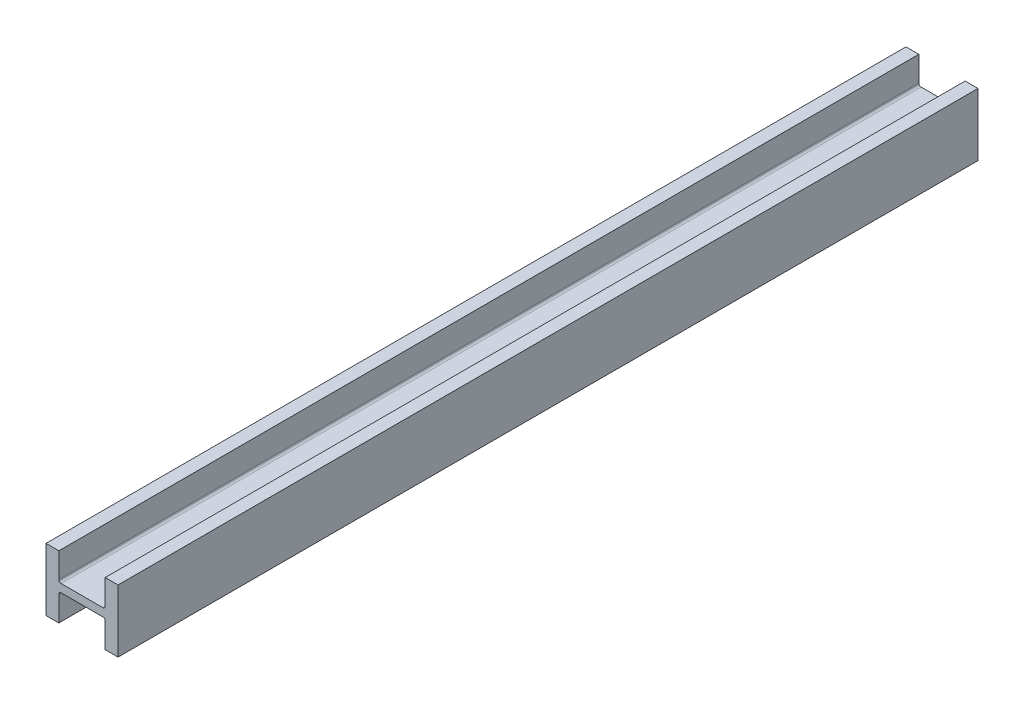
ISO-10303-21;
HEADER;
FILE_DESCRIPTION(('STEP AP214'),'2;1');
FILE_NAME('part.step','',(''),(''),'','','');
FILE_SCHEMA(('AUTOMOTIVE_DESIGN { 1 0 10303 214 1 1 1 1 }'));
ENDSEC;
DATA;
#1=APPLICATION_CONTEXT('core data for automotive mechanical design processes');
#2=APPLICATION_PROTOCOL_DEFINITION('international standard','automotive_design',2000,#1);
#3=PRODUCT_CONTEXT('',#1,'mechanical');
#4=PRODUCT('Part','Part','',(#3));
#5=PRODUCT_RELATED_PRODUCT_CATEGORY('part','',(#4));
#6=PRODUCT_DEFINITION_FORMATION('','',#4);
#7=PRODUCT_DEFINITION_CONTEXT('part definition',#1,'design');
#8=PRODUCT_DEFINITION('design','',#6,#7);
#9=PRODUCT_DEFINITION_SHAPE('','',#8);
#10=(LENGTH_UNIT() NAMED_UNIT(*) SI_UNIT(.MILLI.,.METRE.));
#11=(NAMED_UNIT(*) PLANE_ANGLE_UNIT() SI_UNIT($,.RADIAN.));
#12=(NAMED_UNIT(*) SI_UNIT($,.STERADIAN.) SOLID_ANGLE_UNIT());
#13=UNCERTAINTY_MEASURE_WITH_UNIT(LENGTH_MEASURE(1.E-05),#10,'distance_accuracy_value','');
#14=(GEOMETRIC_REPRESENTATION_CONTEXT(3) GLOBAL_UNCERTAINTY_ASSIGNED_CONTEXT((#13)) GLOBAL_UNIT_ASSIGNED_CONTEXT((#10,
#11,#12)) REPRESENTATION_CONTEXT('',''));
#15=CARTESIAN_POINT('',(0.,0.,0.));
#16=DIRECTION('',(0.,0.,1.));
#17=DIRECTION('',(1.,0.,0.));
#18=AXIS2_PLACEMENT_3D('',#15,#16,#17);
#19=CARTESIAN_POINT('',(248.92,216.027000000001,2971.8));
#20=DIRECTION('',(-1.,0.,0.));
#21=DIRECTION('',(0.,0.,1.));
#22=AXIS2_PLACEMENT_3D('',#19,#20,#21);
#23=PLANE('',#22);
#24=DIRECTION('',(0.,1.,0.));
#25=VECTOR('',#24,1.);
#26=CARTESIAN_POINT('',(248.92,216.027000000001,-2971.8));
#27=LINE('',#26,#25);
#28=CARTESIAN_POINT('',(248.92,-216.026999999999,-2971.8));
#29=VERTEX_POINT('',#28);
#30=CARTESIAN_POINT('',(248.92,216.027000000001,-2971.8));
#31=VERTEX_POINT('',#30);
#32=EDGE_CURVE('E195',#29,#31,#27,.T.);
#33=ORIENTED_EDGE('',*,*,#32,.T.);
#34=DIRECTION('',(0.,0.,-1.));
#35=VECTOR('',#34,1.);
#36=CARTESIAN_POINT('',(248.92,216.027000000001,2971.8));
#37=LINE('',#36,#35);
#38=CARTESIAN_POINT('',(248.92,216.027000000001,2971.8));
#39=VERTEX_POINT('',#38);
#40=EDGE_CURVE('E11',#39,#31,#37,.T.);
#41=ORIENTED_EDGE('',*,*,#40,.F.);
#42=DIRECTION('',(0.,1.,0.));
#43=VECTOR('',#42,1.);
#44=CARTESIAN_POINT('',(248.92,216.027000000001,2971.8));
#45=LINE('',#44,#43);
#46=CARTESIAN_POINT('',(248.92,-216.026999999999,2971.8));
#47=VERTEX_POINT('',#46);
#48=EDGE_CURVE('E238',#47,#39,#45,.T.);
#49=ORIENTED_EDGE('',*,*,#48,.F.);
#50=DIRECTION('',(0.,0.,-1.));
#51=VECTOR('',#50,1.);
#52=CARTESIAN_POINT('',(248.92,-216.026999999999,2971.8));
#53=LINE('',#52,#51);
#54=EDGE_CURVE('E186',#47,#29,#53,.T.);
#55=ORIENTED_EDGE('',*,*,#54,.T.);
#56=EDGE_LOOP('',(#33,#41,#49,#55));
#57=FACE_BOUND('',#56,.T.);
#58=ADVANCED_FACE('F44',(#57),#23,.F.);
#59=CARTESIAN_POINT('',(160.02,216.027000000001,2971.8));
#60=DIRECTION('',(0.,-1.,0.));
#61=DIRECTION('',(0.,0.,-1.));
#62=AXIS2_PLACEMENT_3D('',#59,#60,#61);
#63=PLANE('',#62);
#64=DIRECTION('',(-1.,0.,0.));
#65=VECTOR('',#64,1.);
#66=CARTESIAN_POINT('',(160.02,216.027000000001,-2971.8));
#67=LINE('',#66,#65);
#68=CARTESIAN_POINT('',(160.02,216.027000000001,-2971.8));
#69=VERTEX_POINT('',#68);
#70=EDGE_CURVE('E196',#31,#69,#67,.T.);
#71=ORIENTED_EDGE('',*,*,#70,.T.);
#72=DIRECTION('',(0.,0.,-1.));
#73=VECTOR('',#72,1.);
#74=CARTESIAN_POINT('',(160.02,216.027000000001,2971.8));
#75=LINE('',#74,#73);
#76=CARTESIAN_POINT('',(160.02,216.027000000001,2971.8));
#77=VERTEX_POINT('',#76);
#78=EDGE_CURVE('E53',#77,#69,#75,.T.);
#79=ORIENTED_EDGE('',*,*,#78,.F.);
#80=DIRECTION('',(-1.,0.,0.));
#81=VECTOR('',#80,1.);
#82=CARTESIAN_POINT('',(160.02,216.027000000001,2971.8));
#83=LINE('',#82,#81);
#84=EDGE_CURVE('E129',#39,#77,#83,.T.);
#85=ORIENTED_EDGE('',*,*,#84,.F.);
#86=ORIENTED_EDGE('',*,*,#40,.T.);
#87=EDGE_LOOP('',(#71,#79,#85,#86));
#88=FACE_BOUND('',#87,.T.);
#89=ADVANCED_FACE('F362',(#88),#63,.F.);
#90=CARTESIAN_POINT('',(160.02,43.0530000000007,2971.8));
#91=DIRECTION('',(1.,0.,0.));
#92=DIRECTION('',(0.,0.,-1.));
#93=AXIS2_PLACEMENT_3D('',#90,#91,#92);
#94=PLANE('',#93);
#95=DIRECTION('',(0.,-1.,0.));
#96=VECTOR('',#95,1.);
#97=CARTESIAN_POINT('',(160.02,43.0530000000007,-2971.8));
#98=LINE('',#97,#96);
#99=CARTESIAN_POINT('',(160.02,43.0530000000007,-2971.8));
#100=VERTEX_POINT('',#99);
#101=EDGE_CURVE('E203',#69,#100,#98,.T.);
#102=ORIENTED_EDGE('',*,*,#101,.T.);
#103=DIRECTION('',(0.,0.,-1.));
#104=VECTOR('',#103,1.);
#105=CARTESIAN_POINT('',(160.02,43.0530000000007,2971.8));
#106=LINE('',#105,#104);
#107=CARTESIAN_POINT('',(160.02,43.0530000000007,2971.8));
#108=VERTEX_POINT('',#107);
#109=EDGE_CURVE('E282',#108,#100,#106,.T.);
#110=ORIENTED_EDGE('',*,*,#109,.F.);
#111=DIRECTION('',(0.,-1.,0.));
#112=VECTOR('',#111,1.);
#113=CARTESIAN_POINT('',(160.02,43.0530000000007,2971.8));
#114=LINE('',#113,#112);
#115=EDGE_CURVE('E291',#77,#108,#114,.T.);
#116=ORIENTED_EDGE('',*,*,#115,.F.);
#117=ORIENTED_EDGE('',*,*,#78,.T.);
#118=EDGE_LOOP('',(#102,#110,#116,#117));
#119=FACE_BOUND('',#118,.T.);
#120=ADVANCED_FACE('F292',(#119),#94,.F.);
#121=CARTESIAN_POINT('',(144.78,43.0530000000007,2971.8));
#122=DIRECTION('',(0.,0.,-1.));
#123=DIRECTION('',(-1.,0.,0.));
#124=AXIS2_PLACEMENT_3D('',#121,#122,#123);
#125=CYLINDRICAL_SURFACE('',#124,15.24);
#126=CARTESIAN_POINT('',(144.78,43.0530000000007,-2971.8));
#127=DIRECTION('',(0.,0.,-1.));
#128=DIRECTION('',(1.,0.,0.));
#129=AXIS2_PLACEMENT_3D('',#126,#127,#128);
#130=CIRCLE('',#129,15.24);
#131=CARTESIAN_POINT('',(144.78,27.8130000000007,-2971.8));
#132=VERTEX_POINT('',#131);
#133=EDGE_CURVE('E204',#100,#132,#130,.T.);
#134=ORIENTED_EDGE('',*,*,#133,.T.);
#135=DIRECTION('',(0.,0.,-1.));
#136=VECTOR('',#135,1.);
#137=CARTESIAN_POINT('',(144.78,27.8130000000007,2971.8));
#138=LINE('',#137,#136);
#139=CARTESIAN_POINT('',(144.78,27.8130000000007,2971.8));
#140=VERTEX_POINT('',#139);
#141=EDGE_CURVE('E276',#140,#132,#138,.T.);
#142=ORIENTED_EDGE('',*,*,#141,.F.);
#143=CARTESIAN_POINT('',(144.78,43.0530000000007,2971.8));
#144=DIRECTION('',(0.,0.,-1.));
#145=DIRECTION('',(1.,0.,0.));
#146=AXIS2_PLACEMENT_3D('',#143,#144,#145);
#147=CIRCLE('',#146,15.24);
#148=EDGE_CURVE('E315',#108,#140,#147,.T.);
#149=ORIENTED_EDGE('',*,*,#148,.F.);
#150=ORIENTED_EDGE('',*,*,#109,.T.);
#151=EDGE_LOOP('',(#134,#142,#149,#150));
#152=FACE_BOUND('',#151,.T.);
#153=ADVANCED_FACE('F304',(#152),#125,.F.);
#154=CARTESIAN_POINT('',(-144.78,27.8130000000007,2971.8));
#155=DIRECTION('',(0.,-1.,0.));
#156=DIRECTION('',(0.,0.,-1.));
#157=AXIS2_PLACEMENT_3D('',#154,#155,#156);
#158=PLANE('',#157);
#159=DIRECTION('',(-1.,0.,0.));
#160=VECTOR('',#159,1.);
#161=CARTESIAN_POINT('',(-144.78,27.8130000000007,-2971.8));
#162=LINE('',#161,#160);
#163=CARTESIAN_POINT('',(-144.78,27.8130000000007,-2971.8));
#164=VERTEX_POINT('',#163);
#165=EDGE_CURVE('E210',#132,#164,#162,.T.);
#166=ORIENTED_EDGE('',*,*,#165,.T.);
#167=DIRECTION('',(0.,0.,-1.));
#168=VECTOR('',#167,1.);
#169=CARTESIAN_POINT('',(-144.78,27.8130000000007,2971.8));
#170=LINE('',#169,#168);
#171=CARTESIAN_POINT('',(-144.78,27.8130000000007,2971.8));
#172=VERTEX_POINT('',#171);
#173=EDGE_CURVE('E274',#172,#164,#170,.T.);
#174=ORIENTED_EDGE('',*,*,#173,.F.);
#175=DIRECTION('',(-1.,0.,0.));
#176=VECTOR('',#175,1.);
#177=CARTESIAN_POINT('',(-144.78,27.8130000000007,2971.8));
#178=LINE('',#177,#176);
#179=EDGE_CURVE('E306',#140,#172,#178,.T.);
#180=ORIENTED_EDGE('',*,*,#179,.F.);
#181=ORIENTED_EDGE('',*,*,#141,.T.);
#182=EDGE_LOOP('',(#166,#174,#180,#181));
#183=FACE_BOUND('',#182,.T.);
#184=ADVANCED_FACE('F308',(#183),#158,.F.);
#185=CARTESIAN_POINT('',(-144.78,43.0530000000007,2971.8));
#186=DIRECTION('',(0.,0.,-1.));
#187=DIRECTION('',(-1.,0.,0.));
#188=AXIS2_PLACEMENT_3D('',#185,#186,#187);
#189=CYLINDRICAL_SURFACE('',#188,15.24);
#190=CARTESIAN_POINT('',(-144.78,43.0530000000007,-2971.8));
#191=DIRECTION('',(0.,0.,-1.));
#192=DIRECTION('',(1.,0.,0.));
#193=AXIS2_PLACEMENT_3D('',#190,#191,#192);
#194=CIRCLE('',#193,15.24);
#195=CARTESIAN_POINT('',(-160.02,43.0530000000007,-2971.8));
#196=VERTEX_POINT('',#195);
#197=EDGE_CURVE('E209',#164,#196,#194,.T.);
#198=ORIENTED_EDGE('',*,*,#197,.T.);
#199=DIRECTION('',(0.,0.,-1.));
#200=VECTOR('',#199,1.);
#201=CARTESIAN_POINT('',(-160.02,43.0530000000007,2971.8));
#202=LINE('',#201,#200);
#203=CARTESIAN_POINT('',(-160.02,43.0530000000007,2971.8));
#204=VERTEX_POINT('',#203);
#205=EDGE_CURVE('E271',#204,#196,#202,.T.);
#206=ORIENTED_EDGE('',*,*,#205,.F.);
#207=CARTESIAN_POINT('',(-144.78,43.0530000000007,2971.8));
#208=DIRECTION('',(0.,0.,-1.));
#209=DIRECTION('',(1.,0.,0.));
#210=AXIS2_PLACEMENT_3D('',#207,#208,#209);
#211=CIRCLE('',#210,15.24);
#212=EDGE_CURVE('E313',#172,#204,#211,.T.);
#213=ORIENTED_EDGE('',*,*,#212,.F.);
#214=ORIENTED_EDGE('',*,*,#173,.T.);
#215=EDGE_LOOP('',(#198,#206,#213,#214));
#216=FACE_BOUND('',#215,.T.);
#217=ADVANCED_FACE('F374',(#216),#189,.F.);
#218=CARTESIAN_POINT('',(-160.02,216.027000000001,2971.8));
#219=DIRECTION('',(-1.,0.,0.));
#220=DIRECTION('',(0.,0.,1.));
#221=AXIS2_PLACEMENT_3D('',#218,#219,#220);
#222=PLANE('',#221);
#223=DIRECTION('',(0.,1.,0.));
#224=VECTOR('',#223,1.);
#225=CARTESIAN_POINT('',(-160.02,216.027000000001,-2971.8));
#226=LINE('',#225,#224);
#227=CARTESIAN_POINT('',(-160.02,216.027000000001,-2971.8));
#228=VERTEX_POINT('',#227);
#229=EDGE_CURVE('E213',#196,#228,#226,.T.);
#230=ORIENTED_EDGE('',*,*,#229,.T.);
#231=DIRECTION('',(0.,0.,-1.));
#232=VECTOR('',#231,1.);
#233=CARTESIAN_POINT('',(-160.02,216.027000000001,2971.8));
#234=LINE('',#233,#232);
#235=CARTESIAN_POINT('',(-160.02,216.027000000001,2971.8));
#236=VERTEX_POINT('',#235);
#237=EDGE_CURVE('E270',#236,#228,#234,.T.);
#238=ORIENTED_EDGE('',*,*,#237,.F.);
#239=DIRECTION('',(0.,1.,0.));
#240=VECTOR('',#239,1.);
#241=CARTESIAN_POINT('',(-160.02,216.027000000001,2971.8));
#242=LINE('',#241,#240);
#243=EDGE_CURVE('E316',#204,#236,#242,.T.);
#244=ORIENTED_EDGE('',*,*,#243,.F.);
#245=ORIENTED_EDGE('',*,*,#205,.T.);
#246=EDGE_LOOP('',(#230,#238,#244,#245));
#247=FACE_BOUND('',#246,.T.);
#248=ADVANCED_FACE('F378',(#247),#222,.F.);
#249=CARTESIAN_POINT('',(-248.92,216.027000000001,2971.8));
#250=DIRECTION('',(0.,-1.,0.));
#251=DIRECTION('',(0.,0.,-1.));
#252=AXIS2_PLACEMENT_3D('',#249,#250,#251);
#253=PLANE('',#252);
#254=DIRECTION('',(-1.,0.,0.));
#255=VECTOR('',#254,1.);
#256=CARTESIAN_POINT('',(-248.92,216.027000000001,-2971.8));
#257=LINE('',#256,#255);
#258=CARTESIAN_POINT('',(-248.92,216.027000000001,-2971.8));
#259=VERTEX_POINT('',#258);
#260=EDGE_CURVE('E216',#228,#259,#257,.T.);
#261=ORIENTED_EDGE('',*,*,#260,.T.);
#262=DIRECTION('',(0.,0.,-1.));
#263=VECTOR('',#262,1.);
#264=CARTESIAN_POINT('',(-248.92,216.027000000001,2971.8));
#265=LINE('',#264,#263);
#266=CARTESIAN_POINT('',(-248.92,216.027000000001,2971.8));
#267=VERTEX_POINT('',#266);
#268=EDGE_CURVE('E263',#267,#259,#265,.T.);
#269=ORIENTED_EDGE('',*,*,#268,.F.);
#270=DIRECTION('',(-1.,0.,0.));
#271=VECTOR('',#270,1.);
#272=CARTESIAN_POINT('',(-248.92,216.027000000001,2971.8));
#273=LINE('',#272,#271);
#274=EDGE_CURVE('E323',#236,#267,#273,.T.);
#275=ORIENTED_EDGE('',*,*,#274,.F.);
#276=ORIENTED_EDGE('',*,*,#237,.T.);
#277=EDGE_LOOP('',(#261,#269,#275,#276));
#278=FACE_BOUND('',#277,.T.);
#279=ADVANCED_FACE('F385',(#278),#253,.F.);
#280=CARTESIAN_POINT('',(-248.92,-216.026999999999,2971.8));
#281=DIRECTION('',(1.,0.,0.));
#282=DIRECTION('',(0.,0.,-1.));
#283=AXIS2_PLACEMENT_3D('',#280,#281,#282);
#284=PLANE('',#283);
#285=DIRECTION('',(0.,-1.,0.));
#286=VECTOR('',#285,1.);
#287=CARTESIAN_POINT('',(-248.92,-216.026999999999,-2971.8));
#288=LINE('',#287,#286);
#289=CARTESIAN_POINT('',(-248.92,-216.026999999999,-2971.8));
#290=VERTEX_POINT('',#289);
#291=EDGE_CURVE('E218',#259,#290,#288,.T.);
#292=ORIENTED_EDGE('',*,*,#291,.T.);
#293=DIRECTION('',(0.,0.,-1.));
#294=VECTOR('',#293,1.);
#295=CARTESIAN_POINT('',(-248.92,-216.026999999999,2971.8));
#296=LINE('',#295,#294);
#297=CARTESIAN_POINT('',(-248.92,-216.026999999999,2971.8));
#298=VERTEX_POINT('',#297);
#299=EDGE_CURVE('E259',#298,#290,#296,.T.);
#300=ORIENTED_EDGE('',*,*,#299,.F.);
#301=DIRECTION('',(0.,-1.,0.));
#302=VECTOR('',#301,1.);
#303=CARTESIAN_POINT('',(-248.92,-216.026999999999,2971.8));
#304=LINE('',#303,#302);
#305=EDGE_CURVE('E326',#267,#298,#304,.T.);
#306=ORIENTED_EDGE('',*,*,#305,.F.);
#307=ORIENTED_EDGE('',*,*,#268,.T.);
#308=EDGE_LOOP('',(#292,#300,#306,#307));
#309=FACE_BOUND('',#308,.T.);
#310=ADVANCED_FACE('F387',(#309),#284,.F.);
#311=CARTESIAN_POINT('',(-160.02,-216.026999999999,2971.8));
#312=DIRECTION('',(0.,1.,0.));
#313=DIRECTION('',(0.,0.,1.));
#314=AXIS2_PLACEMENT_3D('',#311,#312,#313);
#315=PLANE('',#314);
#316=DIRECTION('',(1.,0.,0.));
#317=VECTOR('',#316,1.);
#318=CARTESIAN_POINT('',(-160.02,-216.026999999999,-2971.8));
#319=LINE('',#318,#317);
#320=CARTESIAN_POINT('',(-160.02,-216.026999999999,-2971.8));
#321=VERTEX_POINT('',#320);
#322=EDGE_CURVE('E225',#290,#321,#319,.T.);
#323=ORIENTED_EDGE('',*,*,#322,.T.);
#324=DIRECTION('',(0.,0.,-1.));
#325=VECTOR('',#324,1.);
#326=CARTESIAN_POINT('',(-160.02,-216.026999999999,2971.8));
#327=LINE('',#326,#325);
#328=CARTESIAN_POINT('',(-160.02,-216.026999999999,2971.8));
#329=VERTEX_POINT('',#328);
#330=EDGE_CURVE('E254',#329,#321,#327,.T.);
#331=ORIENTED_EDGE('',*,*,#330,.F.);
#332=DIRECTION('',(1.,0.,0.));
#333=VECTOR('',#332,1.);
#334=CARTESIAN_POINT('',(-160.02,-216.026999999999,2971.8));
#335=LINE('',#334,#333);
#336=EDGE_CURVE('E328',#298,#329,#335,.T.);
#337=ORIENTED_EDGE('',*,*,#336,.F.);
#338=ORIENTED_EDGE('',*,*,#299,.T.);
#339=EDGE_LOOP('',(#323,#331,#337,#338));
#340=FACE_BOUND('',#339,.T.);
#341=ADVANCED_FACE('F388',(#340),#315,.F.);
#342=CARTESIAN_POINT('',(-160.02,-43.0529999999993,2971.8));
#343=DIRECTION('',(-1.,0.,0.));
#344=DIRECTION('',(0.,-1.,0.));
#345=AXIS2_PLACEMENT_3D('',#342,#343,#344);
#346=PLANE('',#345);
#347=DIRECTION('',(0.,1.,0.));
#348=VECTOR('',#347,1.);
#349=CARTESIAN_POINT('',(-160.02,-43.0529999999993,-2971.8));
#350=LINE('',#349,#348);
#351=CARTESIAN_POINT('',(-160.02,-43.0529999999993,-2971.8));
#352=VERTEX_POINT('',#351);
#353=EDGE_CURVE('E223',#321,#352,#350,.T.);
#354=ORIENTED_EDGE('',*,*,#353,.T.);
#355=DIRECTION('',(0.,0.,-1.));
#356=VECTOR('',#355,1.);
#357=CARTESIAN_POINT('',(-160.02,-43.0529999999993,2971.8));
#358=LINE('',#357,#356);
#359=CARTESIAN_POINT('',(-160.02,-43.0529999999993,2971.8));
#360=VERTEX_POINT('',#359);
#361=EDGE_CURVE('E253',#360,#352,#358,.T.);
#362=ORIENTED_EDGE('',*,*,#361,.F.);
#363=DIRECTION('',(0.,1.,0.));
#364=VECTOR('',#363,1.);
#365=CARTESIAN_POINT('',(-160.02,-43.0529999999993,2971.8));
#366=LINE('',#365,#364);
#367=EDGE_CURVE('E335',#329,#360,#366,.T.);
#368=ORIENTED_EDGE('',*,*,#367,.F.);
#369=ORIENTED_EDGE('',*,*,#330,.T.);
#370=EDGE_LOOP('',(#354,#362,#368,#369));
#371=FACE_BOUND('',#370,.T.);
#372=ADVANCED_FACE('F395',(#371),#346,.F.);
#373=CARTESIAN_POINT('',(-144.78,-43.0529999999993,2971.8));
#374=DIRECTION('',(0.,0.,-1.));
#375=DIRECTION('',(-1.,0.,0.));
#376=AXIS2_PLACEMENT_3D('',#373,#374,#375);
#377=CYLINDRICAL_SURFACE('',#376,15.24);
#378=CARTESIAN_POINT('',(-144.78,-43.0529999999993,-2971.8));
#379=DIRECTION('',(0.,0.,-1.));
#380=DIRECTION('',(1.,0.,0.));
#381=AXIS2_PLACEMENT_3D('',#378,#379,#380);
#382=CIRCLE('',#381,15.24);
#383=CARTESIAN_POINT('',(-144.78,-27.8129999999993,-2971.8));
#384=VERTEX_POINT('',#383);
#385=EDGE_CURVE('E227',#352,#384,#382,.T.);
#386=ORIENTED_EDGE('',*,*,#385,.T.);
#387=DIRECTION('',(0.,0.,-1.));
#388=VECTOR('',#387,1.);
#389=CARTESIAN_POINT('',(-144.78,-27.8129999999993,2971.8));
#390=LINE('',#389,#388);
#391=CARTESIAN_POINT('',(-144.78,-27.8129999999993,2971.8));
#392=VERTEX_POINT('',#391);
#393=EDGE_CURVE('E249',#392,#384,#390,.T.);
#394=ORIENTED_EDGE('',*,*,#393,.F.);
#395=CARTESIAN_POINT('',(-144.78,-43.0529999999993,2971.8));
#396=DIRECTION('',(0.,0.,-1.));
#397=DIRECTION('',(1.,0.,0.));
#398=AXIS2_PLACEMENT_3D('',#395,#396,#397);
#399=CIRCLE('',#398,15.24);
#400=EDGE_CURVE('E333',#360,#392,#399,.T.);
#401=ORIENTED_EDGE('',*,*,#400,.F.);
#402=ORIENTED_EDGE('',*,*,#361,.T.);
#403=EDGE_LOOP('',(#386,#394,#401,#402));
#404=FACE_BOUND('',#403,.T.);
#405=ADVANCED_FACE('F342',(#404),#377,.F.);
#406=CARTESIAN_POINT('',(144.78,-27.8129999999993,2971.8));
#407=DIRECTION('',(0.,1.,0.));
#408=DIRECTION('',(-1.,0.,0.));
#409=AXIS2_PLACEMENT_3D('',#406,#407,#408);
#410=PLANE('',#409);
#411=DIRECTION('',(1.,0.,0.));
#412=VECTOR('',#411,1.);
#413=CARTESIAN_POINT('',(144.78,-27.8129999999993,-2971.8));
#414=LINE('',#413,#412);
#415=CARTESIAN_POINT('',(144.78,-27.8129999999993,-2971.8));
#416=VERTEX_POINT('',#415);
#417=EDGE_CURVE('E233',#384,#416,#414,.T.);
#418=ORIENTED_EDGE('',*,*,#417,.T.);
#419=DIRECTION('',(0.,0.,-1.));
#420=VECTOR('',#419,1.);
#421=CARTESIAN_POINT('',(144.78,-27.8129999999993,2971.8));
#422=LINE('',#421,#420);
#423=CARTESIAN_POINT('',(144.78,-27.8129999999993,2971.8));
#424=VERTEX_POINT('',#423);
#425=EDGE_CURVE('E181',#424,#416,#422,.T.);
#426=ORIENTED_EDGE('',*,*,#425,.F.);
#427=DIRECTION('',(1.,0.,0.));
#428=VECTOR('',#427,1.);
#429=CARTESIAN_POINT('',(144.78,-27.8129999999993,2971.8));
#430=LINE('',#429,#428);
#431=EDGE_CURVE('E174',#392,#424,#430,.T.);
#432=ORIENTED_EDGE('',*,*,#431,.F.);
#433=ORIENTED_EDGE('',*,*,#393,.T.);
#434=EDGE_LOOP('',(#418,#426,#432,#433));
#435=FACE_BOUND('',#434,.T.);
#436=ADVANCED_FACE('F350',(#435),#410,.F.);
#437=CARTESIAN_POINT('',(144.78,-43.0529999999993,2971.8));
#438=DIRECTION('',(0.,0.,-1.));
#439=DIRECTION('',(-1.,0.,0.));
#440=AXIS2_PLACEMENT_3D('',#437,#438,#439);
#441=CYLINDRICAL_SURFACE('',#440,15.24);
#442=CARTESIAN_POINT('',(144.78,-43.0529999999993,-2971.8));
#443=DIRECTION('',(0.,0.,-1.));
#444=DIRECTION('',(1.,0.,0.));
#445=AXIS2_PLACEMENT_3D('',#442,#443,#444);
#446=CIRCLE('',#445,15.24);
#447=CARTESIAN_POINT('',(160.02,-43.0529999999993,-2971.8));
#448=VERTEX_POINT('',#447);
#449=EDGE_CURVE('E182',#416,#448,#446,.T.);
#450=ORIENTED_EDGE('',*,*,#449,.T.);
#451=DIRECTION('',(0.,0.,-1.));
#452=VECTOR('',#451,1.);
#453=CARTESIAN_POINT('',(160.02,-43.0529999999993,2971.8));
#454=LINE('',#453,#452);
#455=CARTESIAN_POINT('',(160.02,-43.0529999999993,2971.8));
#456=VERTEX_POINT('',#455);
#457=EDGE_CURVE('E177',#456,#448,#454,.T.);
#458=ORIENTED_EDGE('',*,*,#457,.F.);
#459=CARTESIAN_POINT('',(144.78,-43.0529999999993,2971.8));
#460=DIRECTION('',(0.,0.,-1.));
#461=DIRECTION('',(1.,0.,0.));
#462=AXIS2_PLACEMENT_3D('',#459,#460,#461);
#463=CIRCLE('',#462,15.24);
#464=EDGE_CURVE('E167',#424,#456,#463,.T.);
#465=ORIENTED_EDGE('',*,*,#464,.F.);
#466=ORIENTED_EDGE('',*,*,#425,.T.);
#467=EDGE_LOOP('',(#450,#458,#465,#466));
#468=FACE_BOUND('',#467,.T.);
#469=ADVANCED_FACE('F180',(#468),#441,.F.);
#470=CARTESIAN_POINT('',(160.02,-216.026999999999,2971.8));
#471=DIRECTION('',(1.,0.,0.));
#472=DIRECTION('',(0.,0.,-1.));
#473=AXIS2_PLACEMENT_3D('',#470,#471,#472);
#474=PLANE('',#473);
#475=DIRECTION('',(0.,-1.,0.));
#476=VECTOR('',#475,1.);
#477=CARTESIAN_POINT('',(160.02,-216.026999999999,-2971.8));
#478=LINE('',#477,#476);
#479=CARTESIAN_POINT('',(160.02,-216.026999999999,-2971.8));
#480=VERTEX_POINT('',#479);
#481=EDGE_CURVE('E113',#448,#480,#478,.T.);
#482=ORIENTED_EDGE('',*,*,#481,.T.);
#483=DIRECTION('',(0.,0.,-1.));
#484=VECTOR('',#483,1.);
#485=CARTESIAN_POINT('',(160.02,-216.026999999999,2971.8));
#486=LINE('',#485,#484);
#487=CARTESIAN_POINT('',(160.02,-216.026999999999,2971.8));
#488=VERTEX_POINT('',#487);
#489=EDGE_CURVE('E184',#488,#480,#486,.T.);
#490=ORIENTED_EDGE('',*,*,#489,.F.);
#491=DIRECTION('',(0.,-1.,0.));
#492=VECTOR('',#491,1.);
#493=CARTESIAN_POINT('',(160.02,-216.026999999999,2971.8));
#494=LINE('',#493,#492);
#495=EDGE_CURVE('E168',#456,#488,#494,.T.);
#496=ORIENTED_EDGE('',*,*,#495,.F.);
#497=ORIENTED_EDGE('',*,*,#457,.T.);
#498=EDGE_LOOP('',(#482,#490,#496,#497));
#499=FACE_BOUND('',#498,.T.);
#500=ADVANCED_FACE('F188',(#499),#474,.F.);
#501=CARTESIAN_POINT('',(248.92,-216.026999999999,2971.8));
#502=DIRECTION('',(0.,1.,0.));
#503=DIRECTION('',(0.,0.,1.));
#504=AXIS2_PLACEMENT_3D('',#501,#502,#503);
#505=PLANE('',#504);
#506=DIRECTION('',(1.,0.,0.));
#507=VECTOR('',#506,1.);
#508=CARTESIAN_POINT('',(248.92,-216.026999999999,-2971.8));
#509=LINE('',#508,#507);
#510=EDGE_CURVE('E123',#480,#29,#509,.T.);
#511=ORIENTED_EDGE('',*,*,#510,.T.);
#512=ORIENTED_EDGE('',*,*,#54,.F.);
#513=DIRECTION('',(1.,0.,0.));
#514=VECTOR('',#513,1.);
#515=CARTESIAN_POINT('',(248.92,-216.026999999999,2971.8));
#516=LINE('',#515,#514);
#517=EDGE_CURVE('E64',#488,#47,#516,.T.);
#518=ORIENTED_EDGE('',*,*,#517,.F.);
#519=ORIENTED_EDGE('',*,*,#489,.T.);
#520=EDGE_LOOP('',(#511,#512,#518,#519));
#521=FACE_BOUND('',#520,.T.);
#522=ADVANCED_FACE('F353',(#521),#505,.F.);
#523=CARTESIAN_POINT('',(144.78,-43.0529999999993,2971.8));
#524=DIRECTION('',(0.,0.,1.));
#525=DIRECTION('',(1.,0.,0.));
#526=AXIS2_PLACEMENT_3D('',#523,#524,#525);
#527=PLANE('',#526);
#528=ORIENTED_EDGE('',*,*,#48,.T.);
#529=ORIENTED_EDGE('',*,*,#84,.T.);
#530=ORIENTED_EDGE('',*,*,#115,.T.);
#531=ORIENTED_EDGE('',*,*,#148,.T.);
#532=ORIENTED_EDGE('',*,*,#179,.T.);
#533=ORIENTED_EDGE('',*,*,#212,.T.);
#534=ORIENTED_EDGE('',*,*,#243,.T.);
#535=ORIENTED_EDGE('',*,*,#274,.T.);
#536=ORIENTED_EDGE('',*,*,#305,.T.);
#537=ORIENTED_EDGE('',*,*,#336,.T.);
#538=ORIENTED_EDGE('',*,*,#367,.T.);
#539=ORIENTED_EDGE('',*,*,#400,.T.);
#540=ORIENTED_EDGE('',*,*,#431,.T.);
#541=ORIENTED_EDGE('',*,*,#464,.T.);
#542=ORIENTED_EDGE('',*,*,#495,.T.);
#543=ORIENTED_EDGE('',*,*,#517,.T.);
#544=EDGE_LOOP('',(#528,#529,#530,#531,#532,#533,#534,#535,#536,#537,#538,#539,#540,#541,#542,#543));
#545=FACE_BOUND('',#544,.T.);
#546=ADVANCED_FACE('F169',(#545),#527,.T.);
#547=CARTESIAN_POINT('',(144.78,-43.0529999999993,-2971.8));
#548=DIRECTION('',(0.,0.,1.));
#549=DIRECTION('',(1.,0.,0.));
#550=AXIS2_PLACEMENT_3D('',#547,#548,#549);
#551=PLANE('',#550);
#552=ORIENTED_EDGE('',*,*,#32,.F.);
#553=ORIENTED_EDGE('',*,*,#510,.F.);
#554=ORIENTED_EDGE('',*,*,#481,.F.);
#555=ORIENTED_EDGE('',*,*,#449,.F.);
#556=ORIENTED_EDGE('',*,*,#417,.F.);
#557=ORIENTED_EDGE('',*,*,#385,.F.);
#558=ORIENTED_EDGE('',*,*,#353,.F.);
#559=ORIENTED_EDGE('',*,*,#322,.F.);
#560=ORIENTED_EDGE('',*,*,#291,.F.);
#561=ORIENTED_EDGE('',*,*,#260,.F.);
#562=ORIENTED_EDGE('',*,*,#229,.F.);
#563=ORIENTED_EDGE('',*,*,#197,.F.);
#564=ORIENTED_EDGE('',*,*,#165,.F.);
#565=ORIENTED_EDGE('',*,*,#133,.F.);
#566=ORIENTED_EDGE('',*,*,#101,.F.);
#567=ORIENTED_EDGE('',*,*,#70,.F.);
#568=EDGE_LOOP('',(#552,#553,#554,#555,#556,#557,#558,#559,#560,#561,#562,#563,#564,#565,#566,#567));
#569=FACE_BOUND('',#568,.T.);
#570=ADVANCED_FACE('F299',(#569),#551,.F.);
#571=CLOSED_SHELL('',(#58,#89,#120,#153,#184,#217,#248,#279,#310,#341,#372,#405,#436,#469,#500,
#522,#546,#570));
#572=MANIFOLD_SOLID_BREP('B2',#571);
#573=ADVANCED_BREP_SHAPE_REPRESENTATION('',(#18,#572),#14);
#574=SHAPE_DEFINITION_REPRESENTATION(#9,#573);
ENDSEC;
END-ISO-10303-21;
